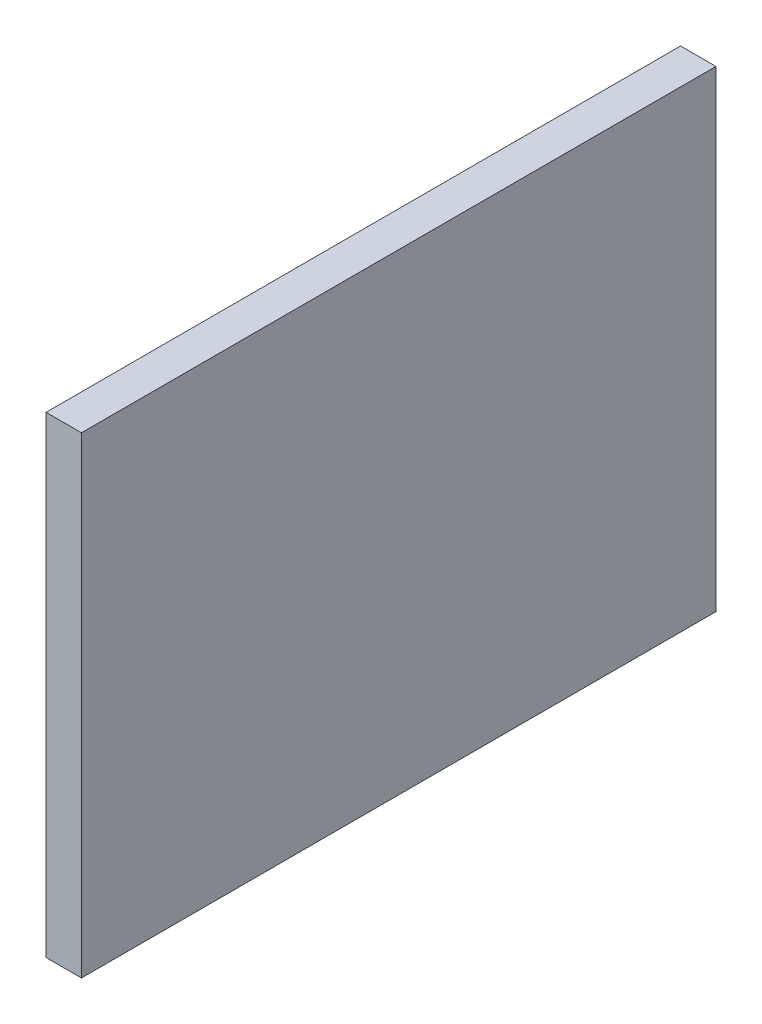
from build123d import *

# Parameters (mm, degrees)
ESQUISSE1_W      = 12
ESQUISSE1_H      = 160
EXTRUSION1_DEPTH = 215


with BuildPart() as part:
    # Esquisse1 → Extrusion1 (new body)
    with BuildSketch(Plane.XY):
        with Locations((6, 80)):
            Rectangle(ESQUISSE1_W, ESQUISSE1_H)
    extrude(amount=EXTRUSION1_DEPTH)


solid = part.part
